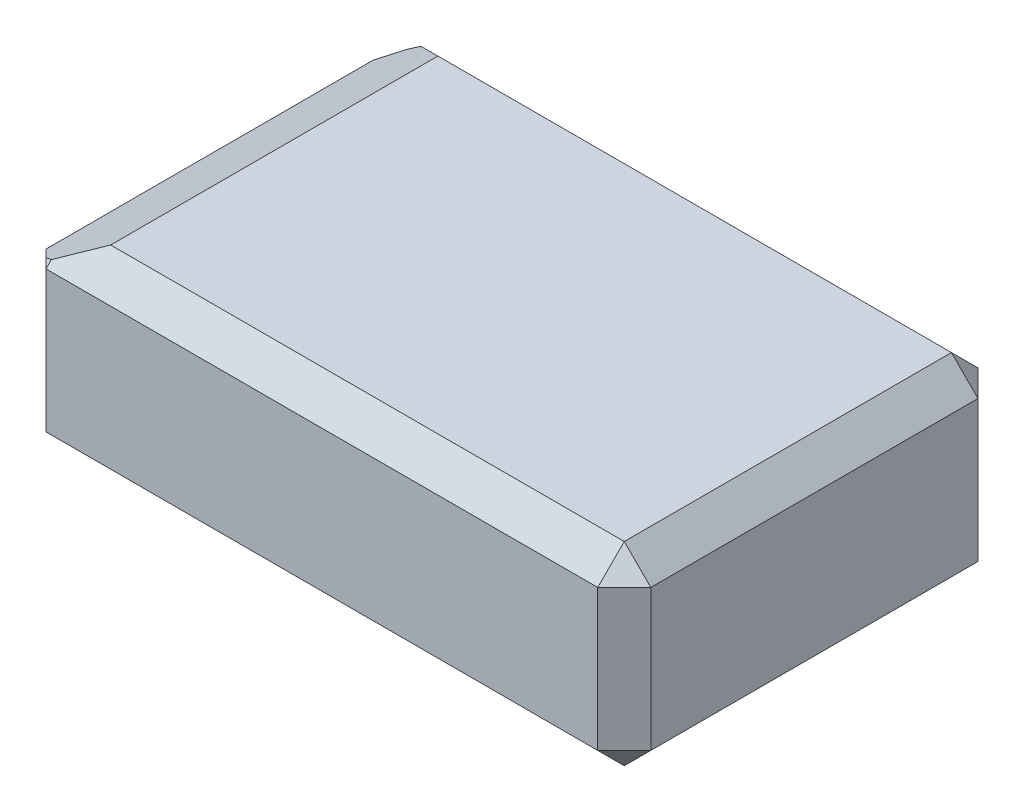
ISO-10303-21;
HEADER;
FILE_DESCRIPTION(('STEP AP214'),'2;1');
FILE_NAME('part.step','',(''),(''),'','','');
FILE_SCHEMA(('AUTOMOTIVE_DESIGN { 1 0 10303 214 1 1 1 1 }'));
ENDSEC;
DATA;
#1=APPLICATION_CONTEXT('core data for automotive mechanical design processes');
#2=APPLICATION_PROTOCOL_DEFINITION('international standard','automotive_design',2000,#1);
#3=PRODUCT_CONTEXT('',#1,'mechanical');
#4=PRODUCT('Part','Part','',(#3));
#5=PRODUCT_RELATED_PRODUCT_CATEGORY('part','',(#4));
#6=PRODUCT_DEFINITION_FORMATION('','',#4);
#7=PRODUCT_DEFINITION_CONTEXT('part definition',#1,'design');
#8=PRODUCT_DEFINITION('design','',#6,#7);
#9=PRODUCT_DEFINITION_SHAPE('','',#8);
#10=(LENGTH_UNIT() NAMED_UNIT(*) SI_UNIT(.MILLI.,.METRE.));
#11=(NAMED_UNIT(*) PLANE_ANGLE_UNIT() SI_UNIT($,.RADIAN.));
#12=(NAMED_UNIT(*) SI_UNIT($,.STERADIAN.) SOLID_ANGLE_UNIT());
#13=UNCERTAINTY_MEASURE_WITH_UNIT(LENGTH_MEASURE(1.E-05),#10,'distance_accuracy_value','');
#14=(GEOMETRIC_REPRESENTATION_CONTEXT(3) GLOBAL_UNCERTAINTY_ASSIGNED_CONTEXT((#13)) GLOBAL_UNIT_ASSIGNED_CONTEXT((#10,
#11,#12)) REPRESENTATION_CONTEXT('',''));
#15=CARTESIAN_POINT('',(0.,0.,0.));
#16=DIRECTION('',(0.,0.,1.));
#17=DIRECTION('',(1.,0.,0.));
#18=AXIS2_PLACEMENT_3D('',#15,#16,#17);
#19=CARTESIAN_POINT('',(-114.,73.22,-71.68));
#20=DIRECTION('',(0.,0.,-1.));
#21=DIRECTION('',(-1.,0.,0.));
#22=AXIS2_PLACEMENT_3D('',#19,#20,#21);
#23=PLANE('',#22);
#24=DIRECTION('',(0.,1.,0.));
#25=VECTOR('',#24,1.);
#26=CARTESIAN_POINT('',(-104.,73.22,-71.68));
#27=LINE('',#26,#25);
#28=CARTESIAN_POINT('',(-104.,10.,-71.68));
#29=VERTEX_POINT('',#28);
#30=CARTESIAN_POINT('',(-104.,63.22,-71.68));
#31=VERTEX_POINT('',#30);
#32=EDGE_CURVE('E274',#29,#31,#27,.T.);
#33=ORIENTED_EDGE('',*,*,#32,.T.);
#34=DIRECTION('',(1.,0.,0.));
#35=VECTOR('',#34,1.);
#36=CARTESIAN_POINT('',(114.,63.22,-71.68));
#37=LINE('',#36,#35);
#38=CARTESIAN_POINT('',(104.,63.22,-71.68));
#39=VERTEX_POINT('',#38);
#40=EDGE_CURVE('E285',#31,#39,#37,.T.);
#41=ORIENTED_EDGE('',*,*,#40,.T.);
#42=DIRECTION('',(0.,-1.,0.));
#43=VECTOR('',#42,1.);
#44=CARTESIAN_POINT('',(104.,73.22,-71.68));
#45=LINE('',#44,#43);
#46=CARTESIAN_POINT('',(104.,10.,-71.68));
#47=VERTEX_POINT('',#46);
#48=EDGE_CURVE('E283',#39,#47,#45,.T.);
#49=ORIENTED_EDGE('',*,*,#48,.T.);
#50=DIRECTION('',(-1.,0.,0.));
#51=VECTOR('',#50,1.);
#52=CARTESIAN_POINT('',(-114.,10.,-71.68));
#53=LINE('',#52,#51);
#54=EDGE_CURVE('E277',#47,#29,#53,.T.);
#55=ORIENTED_EDGE('',*,*,#54,.T.);
#56=EDGE_LOOP('',(#33,#41,#49,#55));
#57=FACE_BOUND('',#56,.T.);
#58=ADVANCED_FACE('F38',(#57),#23,.T.);
#59=CARTESIAN_POINT('',(-114.,73.22,-71.68));
#60=DIRECTION('',(1.,0.,0.));
#61=DIRECTION('',(0.,0.,-1.));
#62=AXIS2_PLACEMENT_3D('',#59,#60,#61);
#63=PLANE('',#62);
#64=DIRECTION('',(0.,1.,0.));
#65=VECTOR('',#64,1.);
#66=CARTESIAN_POINT('',(-114.,73.22,61.68));
#67=LINE('',#66,#65);
#68=CARTESIAN_POINT('',(-114.,10.,61.68));
#69=VERTEX_POINT('',#68);
#70=CARTESIAN_POINT('',(-114.,59.7014374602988,61.68));
#71=VERTEX_POINT('',#70);
#72=EDGE_CURVE('E237',#69,#71,#67,.T.);
#73=ORIENTED_EDGE('',*,*,#72,.T.);
#74=DIRECTION('',(0.,4.80903376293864E-09,-1.));
#75=VECTOR('',#74,1.);
#76=CARTESIAN_POINT('',(-114.,59.7014381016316,-71.6800000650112));
#77=LINE('',#76,#75);
#78=CARTESIAN_POINT('',(-114.,59.7014380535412,-61.68));
#79=VERTEX_POINT('',#78);
#80=EDGE_CURVE('E219',#71,#79,#77,.T.);
#81=ORIENTED_EDGE('',*,*,#80,.T.);
#82=DIRECTION('',(0.,-1.,0.));
#83=VECTOR('',#82,1.);
#84=CARTESIAN_POINT('',(-114.,0.,-61.68));
#85=LINE('',#84,#83);
#86=CARTESIAN_POINT('',(-114.,10.,-61.68));
#87=VERTEX_POINT('',#86);
#88=EDGE_CURVE('E220',#79,#87,#85,.T.);
#89=ORIENTED_EDGE('',*,*,#88,.T.);
#90=DIRECTION('',(0.,0.,1.));
#91=VECTOR('',#90,1.);
#92=CARTESIAN_POINT('',(-114.,10.,71.68));
#93=LINE('',#92,#91);
#94=EDGE_CURVE('E239',#87,#69,#93,.T.);
#95=ORIENTED_EDGE('',*,*,#94,.T.);
#96=EDGE_LOOP('',(#73,#81,#89,#95));
#97=FACE_BOUND('',#96,.T.);
#98=ADVANCED_FACE('F305',(#97),#63,.F.);
#99=CARTESIAN_POINT('',(-114.,73.22,71.68));
#100=DIRECTION('',(0.,0.,-1.));
#101=DIRECTION('',(-1.,0.,0.));
#102=AXIS2_PLACEMENT_3D('',#99,#100,#101);
#103=PLANE('',#102);
#104=DIRECTION('',(0.,1.,0.));
#105=VECTOR('',#104,1.);
#106=CARTESIAN_POINT('',(104.,73.22,71.68));
#107=LINE('',#106,#105);
#108=CARTESIAN_POINT('',(104.,10.,71.68));
#109=VERTEX_POINT('',#108);
#110=CARTESIAN_POINT('',(104.,63.2199999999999,71.68));
#111=VERTEX_POINT('',#110);
#112=EDGE_CURVE('E272',#109,#111,#107,.T.);
#113=ORIENTED_EDGE('',*,*,#112,.T.);
#114=DIRECTION('',(-1.,0.,0.));
#115=VECTOR('',#114,1.);
#116=CARTESIAN_POINT('',(-114.,63.2199999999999,71.68));
#117=LINE('',#116,#115);
#118=CARTESIAN_POINT('',(-104.,63.2199999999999,71.68));
#119=VERTEX_POINT('',#118);
#120=EDGE_CURVE('E261',#111,#119,#117,.T.);
#121=ORIENTED_EDGE('',*,*,#120,.T.);
#122=DIRECTION('',(0.,-1.,0.));
#123=VECTOR('',#122,1.);
#124=CARTESIAN_POINT('',(-104.,73.22,71.68));
#125=LINE('',#124,#123);
#126=CARTESIAN_POINT('',(-104.,10.,71.68));
#127=VERTEX_POINT('',#126);
#128=EDGE_CURVE('E148',#119,#127,#125,.T.);
#129=ORIENTED_EDGE('',*,*,#128,.T.);
#130=DIRECTION('',(1.,0.,0.));
#131=VECTOR('',#130,1.);
#132=CARTESIAN_POINT('',(114.,10.,71.68));
#133=LINE('',#132,#131);
#134=EDGE_CURVE('E268',#127,#109,#133,.T.);
#135=ORIENTED_EDGE('',*,*,#134,.T.);
#136=EDGE_LOOP('',(#113,#121,#129,#135));
#137=FACE_BOUND('',#136,.T.);
#138=ADVANCED_FACE('F270',(#137),#103,.F.);
#139=CARTESIAN_POINT('',(114.,73.22,-71.68));
#140=DIRECTION('',(1.,0.,0.));
#141=DIRECTION('',(0.,0.,-1.));
#142=AXIS2_PLACEMENT_3D('',#139,#140,#141);
#143=PLANE('',#142);
#144=DIRECTION('',(0.,0.,1.));
#145=VECTOR('',#144,1.);
#146=CARTESIAN_POINT('',(114.,63.22,71.68));
#147=LINE('',#146,#145);
#148=CARTESIAN_POINT('',(114.,63.22,-61.6799999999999));
#149=VERTEX_POINT('',#148);
#150=CARTESIAN_POINT('',(114.,63.22,61.68));
#151=VERTEX_POINT('',#150);
#152=EDGE_CURVE('E171',#149,#151,#147,.T.);
#153=ORIENTED_EDGE('',*,*,#152,.T.);
#154=DIRECTION('',(0.,-1.,0.));
#155=VECTOR('',#154,1.);
#156=CARTESIAN_POINT('',(114.,0.,61.68));
#157=LINE('',#156,#155);
#158=CARTESIAN_POINT('',(114.,10.,61.68));
#159=VERTEX_POINT('',#158);
#160=EDGE_CURVE('E293',#151,#159,#157,.T.);
#161=ORIENTED_EDGE('',*,*,#160,.T.);
#162=DIRECTION('',(0.,0.,-1.));
#163=VECTOR('',#162,1.);
#164=CARTESIAN_POINT('',(114.,10.,-71.68));
#165=LINE('',#164,#163);
#166=CARTESIAN_POINT('',(114.,10.,-61.6799999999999));
#167=VERTEX_POINT('',#166);
#168=EDGE_CURVE('E288',#159,#167,#165,.T.);
#169=ORIENTED_EDGE('',*,*,#168,.T.);
#170=DIRECTION('',(0.,1.,0.));
#171=VECTOR('',#170,1.);
#172=CARTESIAN_POINT('',(114.,73.22,-61.6799999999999));
#173=LINE('',#172,#171);
#174=EDGE_CURVE('E290',#167,#149,#173,.T.);
#175=ORIENTED_EDGE('',*,*,#174,.T.);
#176=EDGE_LOOP('',(#153,#161,#169,#175));
#177=FACE_BOUND('',#176,.T.);
#178=ADVANCED_FACE('F408',(#177),#143,.T.);
#179=CARTESIAN_POINT('',(0.,73.22,0.));
#180=DIRECTION('',(0.,-1.,0.));
#181=DIRECTION('',(0.,0.,-1.));
#182=AXIS2_PLACEMENT_3D('',#179,#180,#181);
#183=PLANE('',#182);
#184=DIRECTION('',(-1.,0.,0.));
#185=VECTOR('',#184,1.);
#186=CARTESIAN_POINT('',(-114.,73.22,-61.6799999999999));
#187=LINE('',#186,#185);
#188=CARTESIAN_POINT('',(104.,73.22,-61.6799999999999));
#189=VERTEX_POINT('',#188);
#190=CARTESIAN_POINT('',(-89.6118686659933,73.22,-61.6799999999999));
#191=VERTEX_POINT('',#190);
#192=EDGE_CURVE('E142',#189,#191,#187,.T.);
#193=ORIENTED_EDGE('',*,*,#192,.T.);
#194=DIRECTION('',(8.67572675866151E-09,0.,1.));
#195=VECTOR('',#194,1.);
#196=CARTESIAN_POINT('',(-89.6118681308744,73.22,7.77448082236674E-07));
#197=LINE('',#196,#195);
#198=CARTESIAN_POINT('',(-89.6118675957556,73.22,61.68));
#199=VERTEX_POINT('',#198);
#200=EDGE_CURVE('E61',#191,#199,#197,.T.);
#201=ORIENTED_EDGE('',*,*,#200,.T.);
#202=DIRECTION('',(1.,0.,0.));
#203=VECTOR('',#202,1.);
#204=CARTESIAN_POINT('',(0.,73.22,61.68));
#205=LINE('',#204,#203);
#206=CARTESIAN_POINT('',(104.,73.22,61.68));
#207=VERTEX_POINT('',#206);
#208=EDGE_CURVE('E143',#199,#207,#205,.T.);
#209=ORIENTED_EDGE('',*,*,#208,.T.);
#210=DIRECTION('',(0.,0.,-1.));
#211=VECTOR('',#210,1.);
#212=CARTESIAN_POINT('',(104.,73.22,-71.68));
#213=LINE('',#212,#211);
#214=EDGE_CURVE('E139',#207,#189,#213,.T.);
#215=ORIENTED_EDGE('',*,*,#214,.T.);
#216=EDGE_LOOP('',(#193,#201,#209,#215));
#217=FACE_BOUND('',#216,.T.);
#218=ADVANCED_FACE('F141',(#217),#183,.F.);
#219=CARTESIAN_POINT('',(0.,0.,0.));
#220=DIRECTION('',(0.,-1.,0.));
#221=DIRECTION('',(0.,0.,-1.));
#222=AXIS2_PLACEMENT_3D('',#219,#220,#221);
#223=PLANE('',#222);
#224=DIRECTION('',(0.,0.,1.));
#225=VECTOR('',#224,1.);
#226=CARTESIAN_POINT('',(104.,0.,0.));
#227=LINE('',#226,#225);
#228=CARTESIAN_POINT('',(104.,0.,-61.6799999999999));
#229=VERTEX_POINT('',#228);
#230=CARTESIAN_POINT('',(104.,0.,61.6799999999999));
#231=VERTEX_POINT('',#230);
#232=EDGE_CURVE('E300',#229,#231,#227,.T.);
#233=ORIENTED_EDGE('',*,*,#232,.T.);
#234=DIRECTION('',(-1.,0.,0.));
#235=VECTOR('',#234,1.);
#236=CARTESIAN_POINT('',(-114.,0.,61.6799999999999));
#237=LINE('',#236,#235);
#238=CARTESIAN_POINT('',(-104.,0.,61.6799999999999));
#239=VERTEX_POINT('',#238);
#240=EDGE_CURVE('E302',#231,#239,#237,.T.);
#241=ORIENTED_EDGE('',*,*,#240,.T.);
#242=DIRECTION('',(0.,0.,-1.));
#243=VECTOR('',#242,1.);
#244=CARTESIAN_POINT('',(-104.,0.,-71.68));
#245=LINE('',#244,#243);
#246=CARTESIAN_POINT('',(-104.,0.,-61.6799999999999));
#247=VERTEX_POINT('',#246);
#248=EDGE_CURVE('E296',#239,#247,#245,.T.);
#249=ORIENTED_EDGE('',*,*,#248,.T.);
#250=DIRECTION('',(1.,0.,0.));
#251=VECTOR('',#250,1.);
#252=CARTESIAN_POINT('',(0.,0.,-61.6799999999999));
#253=LINE('',#252,#251);
#254=EDGE_CURVE('E298',#247,#229,#253,.T.);
#255=ORIENTED_EDGE('',*,*,#254,.T.);
#256=EDGE_LOOP('',(#233,#241,#249,#255));
#257=FACE_BOUND('',#256,.T.);
#258=ADVANCED_FACE('F407',(#257),#223,.T.);
#259=CARTESIAN_POINT('',(0.,0.,-61.6799999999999));
#260=DIRECTION('',(0.,0.707106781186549,0.707106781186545));
#261=DIRECTION('',(1.,0.,0.));
#262=AXIS2_PLACEMENT_3D('',#259,#260,#261);
#263=PLANE('',#262);
#264=DIRECTION('',(0.,0.707106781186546,-0.707106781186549));
#265=VECTOR('',#264,1.);
#266=CARTESIAN_POINT('',(-104.,10.,-71.68));
#267=LINE('',#266,#265);
#268=EDGE_CURVE('E159',#29,#247,#267,.F.);
#269=ORIENTED_EDGE('',*,*,#268,.F.);
#270=ORIENTED_EDGE('',*,*,#54,.F.);
#271=DIRECTION('',(0.,-0.707106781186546,0.707106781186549));
#272=VECTOR('',#271,1.);
#273=CARTESIAN_POINT('',(104.,10.,-71.68));
#274=LINE('',#273,#272);
#275=EDGE_CURVE('E209',#229,#47,#274,.F.);
#276=ORIENTED_EDGE('',*,*,#275,.F.);
#277=ORIENTED_EDGE('',*,*,#254,.F.);
#278=EDGE_LOOP('',(#269,#270,#276,#277));
#279=FACE_BOUND('',#278,.T.);
#280=ADVANCED_FACE('F506',(#279),#263,.F.);
#281=CARTESIAN_POINT('',(-104.,10.,-71.68));
#282=DIRECTION('',(-0.577350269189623,-0.577350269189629,-0.577350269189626));
#283=DIRECTION('',(0.,0.707106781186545,-0.707106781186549));
#284=AXIS2_PLACEMENT_3D('',#281,#282,#283);
#285=PLANE('',#284);
#286=DIRECTION('',(0.707106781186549,0.,-0.707106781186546));
#287=VECTOR('',#286,1.);
#288=CARTESIAN_POINT('',(-104.,10.,-71.68));
#289=LINE('',#288,#287);
#290=EDGE_CURVE('E203',#29,#87,#289,.F.);
#291=ORIENTED_EDGE('',*,*,#290,.F.);
#292=ORIENTED_EDGE('',*,*,#268,.T.);
#293=DIRECTION('',(-0.707106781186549,0.707106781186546,0.));
#294=VECTOR('',#293,1.);
#295=CARTESIAN_POINT('',(-109.,5.00000000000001,-61.68));
#296=LINE('',#295,#294);
#297=EDGE_CURVE('E206',#87,#247,#296,.F.);
#298=ORIENTED_EDGE('',*,*,#297,.F.);
#299=EDGE_LOOP('',(#291,#292,#298));
#300=FACE_BOUND('',#299,.T.);
#301=ADVANCED_FACE('F496',(#300),#285,.T.);
#302=CARTESIAN_POINT('',(104.,10.,-71.68));
#303=DIRECTION('',(0.577350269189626,-0.577350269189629,-0.577350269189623));
#304=DIRECTION('',(0.707106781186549,0.707106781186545,0.));
#305=AXIS2_PLACEMENT_3D('',#302,#303,#304);
#306=PLANE('',#305);
#307=DIRECTION('',(0.707106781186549,0.707106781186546,0.));
#308=VECTOR('',#307,1.);
#309=CARTESIAN_POINT('',(109.,5.,-61.6799999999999));
#310=LINE('',#309,#308);
#311=EDGE_CURVE('E197',#229,#167,#310,.T.);
#312=ORIENTED_EDGE('',*,*,#311,.F.);
#313=ORIENTED_EDGE('',*,*,#275,.T.);
#314=DIRECTION('',(-0.707106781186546,0.,-0.707106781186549));
#315=VECTOR('',#314,1.);
#316=CARTESIAN_POINT('',(104.,10.,-71.68));
#317=LINE('',#316,#315);
#318=EDGE_CURVE('E200',#167,#47,#317,.T.);
#319=ORIENTED_EDGE('',*,*,#318,.F.);
#320=EDGE_LOOP('',(#312,#313,#319));
#321=FACE_BOUND('',#320,.T.);
#322=ADVANCED_FACE('F487',(#321),#306,.T.);
#323=CARTESIAN_POINT('',(-114.,10.,-71.68));
#324=DIRECTION('',(-0.707106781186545,-0.707106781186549,0.));
#325=DIRECTION('',(0.,0.,-1.));
#326=AXIS2_PLACEMENT_3D('',#323,#324,#325);
#327=PLANE('',#326);
#328=ORIENTED_EDGE('',*,*,#297,.T.);
#329=ORIENTED_EDGE('',*,*,#248,.F.);
#330=DIRECTION('',(0.707106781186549,-0.707106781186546,0.));
#331=VECTOR('',#330,1.);
#332=CARTESIAN_POINT('',(-104.,0.,61.6799999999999));
#333=LINE('',#332,#331);
#334=EDGE_CURVE('E192',#69,#239,#333,.T.);
#335=ORIENTED_EDGE('',*,*,#334,.F.);
#336=ORIENTED_EDGE('',*,*,#94,.F.);
#337=EDGE_LOOP('',(#328,#329,#335,#336));
#338=FACE_BOUND('',#337,.T.);
#339=ADVANCED_FACE('F309',(#338),#327,.T.);
#340=CARTESIAN_POINT('',(-114.,73.22,-61.68));
#341=DIRECTION('',(-0.707106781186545,0.,-0.707106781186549));
#342=DIRECTION('',(0.,1.,0.));
#343=AXIS2_PLACEMENT_3D('',#340,#341,#342);
#344=PLANE('',#343);
#345=DIRECTION('',(-0.658342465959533,-0.364925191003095,0.65834246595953));
#346=VECTOR('',#345,1.);
#347=CARTESIAN_POINT('',(-110.752222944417,61.5017102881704,-64.9277770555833));
#348=LINE('',#347,#346);
#349=CARTESIAN_POINT('',(-107.652346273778,63.22,-68.0276537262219));
#350=VERTEX_POINT('',#349);
#351=EDGE_CURVE('E222',#350,#79,#348,.T.);
#352=ORIENTED_EDGE('',*,*,#351,.F.);
#353=DIRECTION('',(-0.707106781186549,0.,0.707106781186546));
#354=VECTOR('',#353,1.);
#355=CARTESIAN_POINT('',(-109.,63.22,-66.68));
#356=LINE('',#355,#354);
#357=EDGE_CURVE('E189',#31,#350,#356,.T.);
#358=ORIENTED_EDGE('',*,*,#357,.F.);
#359=ORIENTED_EDGE('',*,*,#32,.F.);
#360=ORIENTED_EDGE('',*,*,#290,.T.);
#361=ORIENTED_EDGE('',*,*,#88,.F.);
#362=EDGE_LOOP('',(#352,#358,#359,#360,#361));
#363=FACE_BOUND('',#362,.T.);
#364=ADVANCED_FACE('F232',(#363),#344,.T.);
#365=CARTESIAN_POINT('',(-114.,63.22,-71.68));
#366=DIRECTION('',(0.,0.707106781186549,-0.707106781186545));
#367=DIRECTION('',(-1.,0.,0.));
#368=AXIS2_PLACEMENT_3D('',#365,#366,#367);
#369=PLANE('',#368);
#370=DIRECTION('',(-0.787007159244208,-0.436245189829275,-0.436245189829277));
#371=VECTOR('',#370,1.);
#372=CARTESIAN_POINT('',(-111.583957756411,61.0406721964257,-73.8593278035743));
#373=LINE('',#372,#371);
#374=CARTESIAN_POINT('',(-104.,65.2445286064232,-69.6554713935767));
#375=VERTEX_POINT('',#374);
#376=EDGE_CURVE('E158',#191,#375,#373,.T.);
#377=ORIENTED_EDGE('',*,*,#376,.F.);
#378=ORIENTED_EDGE('',*,*,#192,.F.);
#379=DIRECTION('',(0.,0.707106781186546,0.707106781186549));
#380=VECTOR('',#379,1.);
#381=CARTESIAN_POINT('',(104.,63.22,-71.68));
#382=LINE('',#381,#380);
#383=EDGE_CURVE('E155',#39,#189,#382,.T.);
#384=ORIENTED_EDGE('',*,*,#383,.F.);
#385=ORIENTED_EDGE('',*,*,#40,.F.);
#386=DIRECTION('',(0.,-0.707106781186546,-0.707106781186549));
#387=VECTOR('',#386,1.);
#388=CARTESIAN_POINT('',(-104.,73.22,-61.6799999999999));
#389=LINE('',#388,#387);
#390=EDGE_CURVE('E168',#375,#31,#389,.T.);
#391=ORIENTED_EDGE('',*,*,#390,.F.);
#392=EDGE_LOOP('',(#377,#378,#384,#385,#391));
#393=FACE_BOUND('',#392,.T.);
#394=ADVANCED_FACE('F153',(#393),#369,.T.);
#395=CARTESIAN_POINT('',(104.,73.22,-71.68));
#396=DIRECTION('',(-0.707106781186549,0.,0.707106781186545));
#397=DIRECTION('',(0.,-1.,0.));
#398=AXIS2_PLACEMENT_3D('',#395,#396,#397);
#399=PLANE('',#398);
#400=ORIENTED_EDGE('',*,*,#318,.T.);
#401=ORIENTED_EDGE('',*,*,#48,.F.);
#402=DIRECTION('',(0.707106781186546,0.,0.707106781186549));
#403=VECTOR('',#402,1.);
#404=CARTESIAN_POINT('',(104.,63.22,-71.68));
#405=LINE('',#404,#403);
#406=EDGE_CURVE('E167',#149,#39,#405,.F.);
#407=ORIENTED_EDGE('',*,*,#406,.F.);
#408=ORIENTED_EDGE('',*,*,#174,.F.);
#409=EDGE_LOOP('',(#400,#401,#407,#408));
#410=FACE_BOUND('',#409,.T.);
#411=ADVANCED_FACE('F386',(#410),#399,.F.);
#412=CARTESIAN_POINT('',(104.,0.,0.));
#413=DIRECTION('',(-0.707106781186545,0.707106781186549,0.));
#414=DIRECTION('',(0.,0.,1.));
#415=AXIS2_PLACEMENT_3D('',#412,#413,#414);
#416=PLANE('',#415);
#417=ORIENTED_EDGE('',*,*,#311,.T.);
#418=ORIENTED_EDGE('',*,*,#168,.F.);
#419=DIRECTION('',(-0.707106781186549,-0.707106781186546,0.));
#420=VECTOR('',#419,1.);
#421=CARTESIAN_POINT('',(114.,10.,61.68));
#422=LINE('',#421,#420);
#423=EDGE_CURVE('E184',#231,#159,#422,.F.);
#424=ORIENTED_EDGE('',*,*,#423,.F.);
#425=ORIENTED_EDGE('',*,*,#232,.F.);
#426=EDGE_LOOP('',(#417,#418,#424,#425));
#427=FACE_BOUND('',#426,.T.);
#428=ADVANCED_FACE('F464',(#427),#416,.F.);
#429=CARTESIAN_POINT('',(-114.,10.,71.68));
#430=DIRECTION('',(0.,-0.707106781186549,0.707106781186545));
#431=DIRECTION('',(-1.,0.,0.));
#432=AXIS2_PLACEMENT_3D('',#429,#430,#431);
#433=PLANE('',#432);
#434=DIRECTION('',(0.,0.707106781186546,0.707106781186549));
#435=VECTOR('',#434,1.);
#436=CARTESIAN_POINT('',(-104.,0.,61.6799999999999));
#437=LINE('',#436,#435);
#438=EDGE_CURVE('E194',#239,#127,#437,.T.);
#439=ORIENTED_EDGE('',*,*,#438,.F.);
#440=ORIENTED_EDGE('',*,*,#240,.F.);
#441=DIRECTION('',(0.,-0.707106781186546,-0.707106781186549));
#442=VECTOR('',#441,1.);
#443=CARTESIAN_POINT('',(104.,5.,66.68));
#444=LINE('',#443,#442);
#445=EDGE_CURVE('E176',#109,#231,#444,.T.);
#446=ORIENTED_EDGE('',*,*,#445,.F.);
#447=ORIENTED_EDGE('',*,*,#134,.F.);
#448=EDGE_LOOP('',(#439,#440,#446,#447));
#449=FACE_BOUND('',#448,.T.);
#450=ADVANCED_FACE('F318',(#449),#433,.T.);
#451=CARTESIAN_POINT('',(-104.,0.,61.6799999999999));
#452=DIRECTION('',(-0.577350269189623,-0.577350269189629,0.577350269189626));
#453=DIRECTION('',(0.,-0.707106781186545,-0.707106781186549));
#454=AXIS2_PLACEMENT_3D('',#451,#452,#453);
#455=PLANE('',#454);
#456=ORIENTED_EDGE('',*,*,#334,.T.);
#457=ORIENTED_EDGE('',*,*,#438,.T.);
#458=DIRECTION('',(0.707106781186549,0.,0.707106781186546));
#459=VECTOR('',#458,1.);
#460=CARTESIAN_POINT('',(-109.,10.,66.68));
#461=LINE('',#460,#459);
#462=EDGE_CURVE('E172',#69,#127,#461,.T.);
#463=ORIENTED_EDGE('',*,*,#462,.F.);
#464=EDGE_LOOP('',(#456,#457,#463));
#465=FACE_BOUND('',#464,.T.);
#466=ADVANCED_FACE('F312',(#465),#455,.T.);
#467=CARTESIAN_POINT('',(-104.,73.22,-61.6799999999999));
#468=DIRECTION('',(-0.577350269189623,0.577350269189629,-0.577350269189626));
#469=DIRECTION('',(0.,0.707106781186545,0.707106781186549));
#470=AXIS2_PLACEMENT_3D('',#467,#468,#469);
#471=PLANE('',#470);
#472=DIRECTION('',(-0.814895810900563,-0.451704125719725,0.363191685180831));
#473=VECTOR('',#472,1.);
#474=CARTESIAN_POINT('',(-103.424741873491,65.563399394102,-69.9118587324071));
#475=LINE('',#474,#473);
#476=EDGE_CURVE('E42',#375,#350,#475,.T.);
#477=ORIENTED_EDGE('',*,*,#476,.F.);
#478=ORIENTED_EDGE('',*,*,#390,.T.);
#479=ORIENTED_EDGE('',*,*,#357,.T.);
#480=EDGE_LOOP('',(#477,#478,#479));
#481=FACE_BOUND('',#480,.T.);
#482=ADVANCED_FACE('F368',(#481),#471,.T.);
#483=CARTESIAN_POINT('',(104.,63.22,-71.68));
#484=DIRECTION('',(0.577350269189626,0.577350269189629,-0.577350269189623));
#485=DIRECTION('',(-0.707106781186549,0.707106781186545,0.));
#486=AXIS2_PLACEMENT_3D('',#483,#484,#485);
#487=PLANE('',#486);
#488=ORIENTED_EDGE('',*,*,#406,.T.);
#489=ORIENTED_EDGE('',*,*,#383,.T.);
#490=DIRECTION('',(0.707106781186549,-0.707106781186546,0.));
#491=VECTOR('',#490,1.);
#492=CARTESIAN_POINT('',(109.,68.22,-61.6799999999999));
#493=LINE('',#492,#491);
#494=EDGE_CURVE('E164',#149,#189,#493,.F.);
#495=ORIENTED_EDGE('',*,*,#494,.F.);
#496=EDGE_LOOP('',(#488,#489,#495));
#497=FACE_BOUND('',#496,.T.);
#498=ADVANCED_FACE('F163',(#497),#487,.T.);
#499=CARTESIAN_POINT('',(114.,10.,61.68));
#500=DIRECTION('',(0.577350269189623,-0.577350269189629,0.577350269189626));
#501=DIRECTION('',(0.,-0.707106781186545,-0.707106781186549));
#502=AXIS2_PLACEMENT_3D('',#499,#500,#501);
#503=PLANE('',#502);
#504=ORIENTED_EDGE('',*,*,#445,.T.);
#505=ORIENTED_EDGE('',*,*,#423,.T.);
#506=DIRECTION('',(-0.707106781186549,0.,0.707106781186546));
#507=VECTOR('',#506,1.);
#508=CARTESIAN_POINT('',(114.,10.,61.68));
#509=LINE('',#508,#507);
#510=EDGE_CURVE('E173',#109,#159,#509,.F.);
#511=ORIENTED_EDGE('',*,*,#510,.F.);
#512=EDGE_LOOP('',(#504,#505,#511));
#513=FACE_BOUND('',#512,.T.);
#514=ADVANCED_FACE('F321',(#513),#503,.T.);
#515=CARTESIAN_POINT('',(-104.,73.22,71.68));
#516=DIRECTION('',(0.707106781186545,0.,-0.707106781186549));
#517=DIRECTION('',(0.,-1.,0.));
#518=AXIS2_PLACEMENT_3D('',#515,#516,#517);
#519=PLANE('',#518);
#520=DIRECTION('',(-0.658342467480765,-0.364925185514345,-0.658342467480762));
#521=VECTOR('',#520,1.);
#522=CARTESIAN_POINT('',(-102.083926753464,66.3066246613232,73.5960732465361));
#523=LINE('',#522,#521);
#524=CARTESIAN_POINT('',(-107.6523450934,63.2199999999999,68.0276549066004));
#525=VERTEX_POINT('',#524);
#526=EDGE_CURVE('E215',#71,#525,#523,.F.);
#527=ORIENTED_EDGE('',*,*,#526,.F.);
#528=ORIENTED_EDGE('',*,*,#72,.F.);
#529=ORIENTED_EDGE('',*,*,#462,.T.);
#530=ORIENTED_EDGE('',*,*,#128,.F.);
#531=DIRECTION('',(-0.707106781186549,0.,-0.707106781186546));
#532=VECTOR('',#531,1.);
#533=CARTESIAN_POINT('',(-104.,63.2199999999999,71.68));
#534=LINE('',#533,#532);
#535=EDGE_CURVE('E178',#525,#119,#534,.F.);
#536=ORIENTED_EDGE('',*,*,#535,.F.);
#537=EDGE_LOOP('',(#527,#528,#529,#530,#536));
#538=FACE_BOUND('',#537,.T.);
#539=ADVANCED_FACE('F263',(#538),#519,.F.);
#540=CARTESIAN_POINT('',(114.,63.22,-71.68));
#541=DIRECTION('',(0.707106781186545,0.707106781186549,0.));
#542=DIRECTION('',(0.,0.,-1.));
#543=AXIS2_PLACEMENT_3D('',#540,#541,#542);
#544=PLANE('',#543);
#545=ORIENTED_EDGE('',*,*,#494,.T.);
#546=ORIENTED_EDGE('',*,*,#214,.F.);
#547=DIRECTION('',(-0.707106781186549,0.707106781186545,0.));
#548=VECTOR('',#547,1.);
#549=CARTESIAN_POINT('',(104.,73.22,61.68));
#550=LINE('',#549,#548);
#551=EDGE_CURVE('E250',#151,#207,#550,.T.);
#552=ORIENTED_EDGE('',*,*,#551,.F.);
#553=ORIENTED_EDGE('',*,*,#152,.F.);
#554=EDGE_LOOP('',(#545,#546,#552,#553));
#555=FACE_BOUND('',#554,.T.);
#556=ADVANCED_FACE('F170',(#555),#544,.T.);
#557=CARTESIAN_POINT('',(114.,73.22,61.68));
#558=DIRECTION('',(0.707106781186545,0.,0.707106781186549));
#559=DIRECTION('',(0.,1.,0.));
#560=AXIS2_PLACEMENT_3D('',#557,#558,#559);
#561=PLANE('',#560);
#562=ORIENTED_EDGE('',*,*,#510,.T.);
#563=ORIENTED_EDGE('',*,*,#160,.F.);
#564=DIRECTION('',(0.707106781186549,0.,-0.707106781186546));
#565=VECTOR('',#564,1.);
#566=CARTESIAN_POINT('',(109.,63.22,66.68));
#567=LINE('',#566,#565);
#568=EDGE_CURVE('E247',#111,#151,#567,.T.);
#569=ORIENTED_EDGE('',*,*,#568,.F.);
#570=ORIENTED_EDGE('',*,*,#112,.F.);
#571=EDGE_LOOP('',(#562,#563,#569,#570));
#572=FACE_BOUND('',#571,.T.);
#573=ADVANCED_FACE('F325',(#572),#561,.T.);
#574=CARTESIAN_POINT('',(-104.,63.2199999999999,71.68));
#575=DIRECTION('',(-0.577350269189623,0.577350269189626,0.577350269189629));
#576=DIRECTION('',(0.,-0.707106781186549,0.707106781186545));
#577=AXIS2_PLACEMENT_3D('',#574,#575,#576);
#578=PLANE('',#577);
#579=DIRECTION('',(0.814895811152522,0.451704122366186,0.36319168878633));
#580=VECTOR('',#579,1.);
#581=CARTESIAN_POINT('',(-104.14602598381,65.163584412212,69.590389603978));
#582=LINE('',#581,#580);
#583=CARTESIAN_POINT('',(-104.,65.2445279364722,69.6554720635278));
#584=VERTEX_POINT('',#583);
#585=EDGE_CURVE('E47',#525,#584,#582,.T.);
#586=ORIENTED_EDGE('',*,*,#585,.F.);
#587=ORIENTED_EDGE('',*,*,#535,.T.);
#588=DIRECTION('',(0.,-0.707106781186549,0.707106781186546));
#589=VECTOR('',#588,1.);
#590=CARTESIAN_POINT('',(-104.,63.2199999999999,71.68));
#591=LINE('',#590,#589);
#592=EDGE_CURVE('E245',#584,#119,#591,.T.);
#593=ORIENTED_EDGE('',*,*,#592,.F.);
#594=EDGE_LOOP('',(#586,#587,#593));
#595=FACE_BOUND('',#594,.T.);
#596=ADVANCED_FACE('F255',(#595),#578,.T.);
#597=CARTESIAN_POINT('',(104.,73.22,61.68));
#598=DIRECTION('',(0.577350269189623,0.577350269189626,0.577350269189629));
#599=DIRECTION('',(0.,-0.707106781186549,0.707106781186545));
#600=AXIS2_PLACEMENT_3D('',#597,#598,#599);
#601=PLANE('',#600);
#602=ORIENTED_EDGE('',*,*,#568,.T.);
#603=ORIENTED_EDGE('',*,*,#551,.T.);
#604=DIRECTION('',(0.,0.707106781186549,-0.707106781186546));
#605=VECTOR('',#604,1.);
#606=CARTESIAN_POINT('',(104.,73.22,61.68));
#607=LINE('',#606,#605);
#608=EDGE_CURVE('E243',#111,#207,#607,.T.);
#609=ORIENTED_EDGE('',*,*,#608,.F.);
#610=EDGE_LOOP('',(#602,#603,#609));
#611=FACE_BOUND('',#610,.T.);
#612=ADVANCED_FACE('F327',(#611),#601,.T.);
#613=CARTESIAN_POINT('',(0.,73.22,61.68));
#614=DIRECTION('',(0.,-0.707106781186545,-0.707106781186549));
#615=DIRECTION('',(1.,0.,0.));
#616=AXIS2_PLACEMENT_3D('',#613,#614,#615);
#617=PLANE('',#616);
#618=DIRECTION('',(-0.787007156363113,-0.436245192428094,0.436245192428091));
#619=VECTOR('',#618,1.);
#620=CARTESIAN_POINT('',(-34.1080453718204,103.986271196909,30.9137288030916));
#621=LINE('',#620,#619);
#622=EDGE_CURVE('E13',#584,#199,#621,.F.);
#623=ORIENTED_EDGE('',*,*,#622,.F.);
#624=ORIENTED_EDGE('',*,*,#592,.T.);
#625=ORIENTED_EDGE('',*,*,#120,.F.);
#626=ORIENTED_EDGE('',*,*,#608,.T.);
#627=ORIENTED_EDGE('',*,*,#208,.F.);
#628=EDGE_LOOP('',(#623,#624,#625,#626,#627));
#629=FACE_BOUND('',#628,.T.);
#630=ADVANCED_FACE('F259',(#629),#617,.F.);
#631=CARTESIAN_POINT('',(-155.658056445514,36.6099996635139,70.6435904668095));
#632=DIRECTION('',(0.484809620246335,-0.874619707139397,-4.20607579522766E-09));
#633=DIRECTION('',(0.874619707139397,0.484809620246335,0.));
#634=AXIS2_PLACEMENT_3D('',#631,#632,#633);
#635=PLANE('',#634);
#636=ORIENTED_EDGE('',*,*,#476,.T.);
#637=ORIENTED_EDGE('',*,*,#351,.T.);
#638=ORIENTED_EDGE('',*,*,#80,.F.);
#639=ORIENTED_EDGE('',*,*,#526,.T.);
#640=ORIENTED_EDGE('',*,*,#585,.T.);
#641=ORIENTED_EDGE('',*,*,#622,.T.);
#642=ORIENTED_EDGE('',*,*,#200,.F.);
#643=ORIENTED_EDGE('',*,*,#376,.T.);
#644=EDGE_LOOP('',(#636,#637,#638,#639,#640,#641,#642,#643));
#645=FACE_BOUND('',#644,.T.);
#646=ADVANCED_FACE('F40',(#645),#635,.F.);
#647=CLOSED_SHELL('',(#58,#98,#138,#178,#218,#258,#280,#301,#322,#339,#364,#394,#411,#428,#450,
#466,#482,#498,#514,#539,#556,#573,#596,#612,#630,#646));
#648=MANIFOLD_SOLID_BREP('B2',#647);
#649=ADVANCED_BREP_SHAPE_REPRESENTATION('',(#18,#648),#14);
#650=SHAPE_DEFINITION_REPRESENTATION(#9,#649);
ENDSEC;
END-ISO-10303-21;
